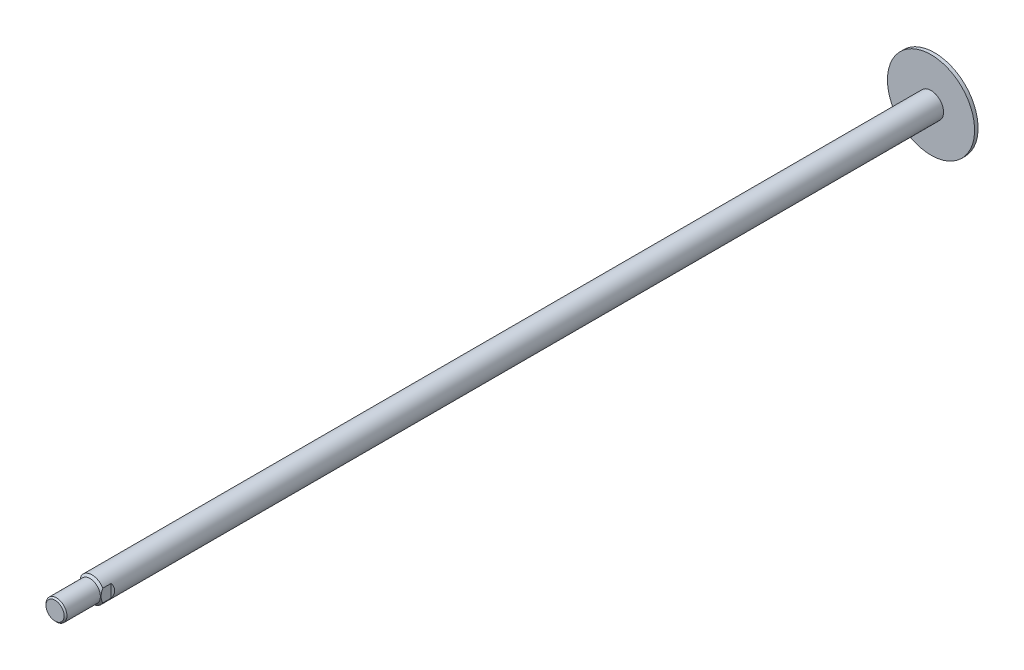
ISO-10303-21;
HEADER;
FILE_DESCRIPTION(('STEP AP214'),'2;1');
FILE_NAME('part.step','',(''),(''),'','','');
FILE_SCHEMA(('AUTOMOTIVE_DESIGN { 1 0 10303 214 1 1 1 1 }'));
ENDSEC;
DATA;
#1=APPLICATION_CONTEXT('core data for automotive mechanical design processes');
#2=APPLICATION_PROTOCOL_DEFINITION('international standard','automotive_design',2000,#1);
#3=PRODUCT_CONTEXT('',#1,'mechanical');
#4=PRODUCT('Part','Part','',(#3));
#5=PRODUCT_RELATED_PRODUCT_CATEGORY('part','',(#4));
#6=PRODUCT_DEFINITION_FORMATION('','',#4);
#7=PRODUCT_DEFINITION_CONTEXT('part definition',#1,'design');
#8=PRODUCT_DEFINITION('design','',#6,#7);
#9=PRODUCT_DEFINITION_SHAPE('','',#8);
#10=(LENGTH_UNIT() NAMED_UNIT(*) SI_UNIT(.MILLI.,.METRE.));
#11=(NAMED_UNIT(*) PLANE_ANGLE_UNIT() SI_UNIT($,.RADIAN.));
#12=(NAMED_UNIT(*) SI_UNIT($,.STERADIAN.) SOLID_ANGLE_UNIT());
#13=UNCERTAINTY_MEASURE_WITH_UNIT(LENGTH_MEASURE(1.E-05),#10,'distance_accuracy_value','');
#14=(GEOMETRIC_REPRESENTATION_CONTEXT(3) GLOBAL_UNCERTAINTY_ASSIGNED_CONTEXT((#13)) GLOBAL_UNIT_ASSIGNED_CONTEXT((#10,
#11,#12)) REPRESENTATION_CONTEXT('',''));
#15=CARTESIAN_POINT('',(0.,0.,0.));
#16=DIRECTION('',(0.,0.,1.));
#17=DIRECTION('',(1.,0.,0.));
#18=AXIS2_PLACEMENT_3D('',#15,#16,#17);
#19=CARTESIAN_POINT('',(0.,0.,1312.41168824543));
#20=DIRECTION('',(0.,0.,-1.));
#21=DIRECTION('',(-1.,0.,0.));
#22=AXIS2_PLACEMENT_3D('',#19,#20,#21);
#23=CYLINDRICAL_SURFACE('',#22,18.);
#24=DIRECTION('',(0.,0.,-1.));
#25=VECTOR('',#24,1.);
#26=CARTESIAN_POINT('',(-15.4999999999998,-9.15150260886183,1312.41168824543));
#27=LINE('',#26,#25);
#28=CARTESIAN_POINT('',(-15.4999999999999,-9.15150260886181,1208.5));
#29=VERTEX_POINT('',#28);
#30=CARTESIAN_POINT('',(-15.4999999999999,-9.15150260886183,1196.5));
#31=VERTEX_POINT('',#30);
#32=EDGE_CURVE('E48',#29,#31,#27,.T.);
#33=ORIENTED_EDGE('',*,*,#32,.T.);
#34=CARTESIAN_POINT('',(0.,0.,1212.));
#35=DIRECTION('',(0.707106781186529,0.,-0.707106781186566));
#36=DIRECTION('',(-0.707106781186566,0.,-0.707106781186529));
#37=AXIS2_PLACEMENT_3D('',#34,#35,#36);
#38=ELLIPSE('',#37,25.4558441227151,18.);
#39=CARTESIAN_POINT('',(-15.4999999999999,9.15150260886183,1196.5));
#40=VERTEX_POINT('',#39);
#41=EDGE_CURVE('E11',#31,#40,#38,.T.);
#42=ORIENTED_EDGE('',*,*,#41,.T.);
#43=DIRECTION('',(0.,0.,-1.));
#44=VECTOR('',#43,1.);
#45=CARTESIAN_POINT('',(-15.4999999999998,9.15150260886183,1312.41168824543));
#46=LINE('',#45,#44);
#47=CARTESIAN_POINT('',(-15.4999999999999,9.15150260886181,1208.5));
#48=VERTEX_POINT('',#47);
#49=EDGE_CURVE('E79',#40,#48,#46,.F.);
#50=ORIENTED_EDGE('',*,*,#49,.T.);
#51=CARTESIAN_POINT('',(0.,0.,1208.5));
#52=DIRECTION('',(0.,0.,-1.));
#53=DIRECTION('',(-1.,0.,0.));
#54=AXIS2_PLACEMENT_3D('',#51,#52,#53);
#55=CIRCLE('',#54,18.);
#56=CARTESIAN_POINT('',(15.5000000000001,9.15150260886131,1208.5));
#57=VERTEX_POINT('',#56);
#58=EDGE_CURVE('E56',#48,#57,#55,.T.);
#59=ORIENTED_EDGE('',*,*,#58,.T.);
#60=DIRECTION('',(0.,0.,-1.));
#61=VECTOR('',#60,1.);
#62=CARTESIAN_POINT('',(15.5000000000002,9.15150260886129,1312.41168824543));
#63=LINE('',#62,#61);
#64=CARTESIAN_POINT('',(15.5000000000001,9.15150260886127,1196.5));
#65=VERTEX_POINT('',#64);
#66=EDGE_CURVE('E94',#57,#65,#63,.T.);
#67=ORIENTED_EDGE('',*,*,#66,.T.);
#68=CARTESIAN_POINT('',(0.,0.,1212.));
#69=DIRECTION('',(-0.707106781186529,0.,-0.707106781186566));
#70=DIRECTION('',(0.707106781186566,0.,-0.707106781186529));
#71=AXIS2_PLACEMENT_3D('',#68,#69,#70);
#72=ELLIPSE('',#71,25.4558441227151,18.);
#73=CARTESIAN_POINT('',(15.5000000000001,-9.15150260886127,1196.5));
#74=VERTEX_POINT('',#73);
#75=EDGE_CURVE('E123',#65,#74,#72,.T.);
#76=ORIENTED_EDGE('',*,*,#75,.T.);
#77=DIRECTION('',(0.,0.,-1.));
#78=VECTOR('',#77,1.);
#79=CARTESIAN_POINT('',(15.5000000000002,-9.15150260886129,1312.41168824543));
#80=LINE('',#79,#78);
#81=CARTESIAN_POINT('',(15.5000000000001,-9.15150260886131,1208.5));
#82=VERTEX_POINT('',#81);
#83=EDGE_CURVE('E89',#74,#82,#80,.F.);
#84=ORIENTED_EDGE('',*,*,#83,.T.);
#85=EDGE_CURVE('E85',#82,#29,#55,.T.);
#86=ORIENTED_EDGE('',*,*,#85,.T.);
#87=EDGE_LOOP('',(#33,#42,#50,#59,#67,#76,#84,#86));
#88=FACE_BOUND('',#87,.T.);
#89=CARTESIAN_POINT('',(0.,0.,5.));
#90=DIRECTION('',(0.,0.,-1.));
#91=DIRECTION('',(-1.,0.,0.));
#92=AXIS2_PLACEMENT_3D('',#89,#90,#91);
#93=CIRCLE('',#92,18.);
#94=CARTESIAN_POINT('',(-18.,0.,5.));
#95=VERTEX_POINT('',#94);
#96=EDGE_CURVE('E110',#95,#95,#93,.T.);
#97=ORIENTED_EDGE('',*,*,#96,.F.);
#98=EDGE_LOOP('',(#97));
#99=FACE_BOUND('',#98,.T.);
#100=ADVANCED_FACE('F34',(#88,#99),#23,.T.);
#101=CARTESIAN_POINT('',(0.,0.,5.));
#102=DIRECTION('',(0.,0.,-1.));
#103=DIRECTION('',(-1.,0.,0.));
#104=AXIS2_PLACEMENT_3D('',#101,#102,#103);
#105=PLANE('',#104);
#106=CARTESIAN_POINT('',(0.,0.,5.));
#107=DIRECTION('',(0.,0.,-1.));
#108=DIRECTION('',(-1.,0.,0.));
#109=AXIS2_PLACEMENT_3D('',#106,#107,#108);
#110=CIRCLE('',#109,62.5);
#111=CARTESIAN_POINT('',(-62.5,0.,5.));
#112=VERTEX_POINT('',#111);
#113=EDGE_CURVE('E107',#112,#112,#110,.T.);
#114=ORIENTED_EDGE('',*,*,#113,.F.);
#115=EDGE_LOOP('',(#114));
#116=FACE_BOUND('',#115,.T.);
#117=ORIENTED_EDGE('',*,*,#96,.T.);
#118=EDGE_LOOP('',(#117));
#119=FACE_BOUND('',#118,.T.);
#120=ADVANCED_FACE('F145',(#116,#119),#105,.F.);
#121=CARTESIAN_POINT('',(0.,0.,5.));
#122=DIRECTION('',(0.,0.,-1.));
#123=DIRECTION('',(-1.,0.,0.));
#124=AXIS2_PLACEMENT_3D('',#121,#122,#123);
#125=CYLINDRICAL_SURFACE('',#124,62.5);
#126=ORIENTED_EDGE('',*,*,#113,.T.);
#127=EDGE_LOOP('',(#126));
#128=FACE_BOUND('',#127,.T.);
#129=CARTESIAN_POINT('',(0.,0.,0.));
#130=DIRECTION('',(0.,0.,-1.));
#131=DIRECTION('',(-1.,0.,0.));
#132=AXIS2_PLACEMENT_3D('',#129,#130,#131);
#133=CIRCLE('',#132,62.5);
#134=CARTESIAN_POINT('',(-62.5,0.,0.));
#135=VERTEX_POINT('',#134);
#136=EDGE_CURVE('E106',#135,#135,#133,.T.);
#137=ORIENTED_EDGE('',*,*,#136,.F.);
#138=EDGE_LOOP('',(#137));
#139=FACE_BOUND('',#138,.T.);
#140=ADVANCED_FACE('F149',(#128,#139),#125,.T.);
#141=CARTESIAN_POINT('',(0.,0.,0.));
#142=DIRECTION('',(0.,0.,1.));
#143=DIRECTION('',(1.,0.,0.));
#144=AXIS2_PLACEMENT_3D('',#141,#142,#143);
#145=PLANE('',#144);
#146=ORIENTED_EDGE('',*,*,#136,.T.);
#147=EDGE_LOOP('',(#146));
#148=FACE_BOUND('',#147,.T.);
#149=ADVANCED_FACE('F155',(#148),#145,.F.);
#150=CARTESIAN_POINT('',(0.,0.,1261.5));
#151=DIRECTION('',(0.,0.,-1.));
#152=DIRECTION('',(-1.,0.,0.));
#153=AXIS2_PLACEMENT_3D('',#150,#151,#152);
#154=CONICAL_SURFACE('',#153,12.9999999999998,0.785398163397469);
#155=CARTESIAN_POINT('',(0.,0.,1259.5));
#156=DIRECTION('',(0.,0.,-1.));
#157=DIRECTION('',(-1.,0.,0.));
#158=AXIS2_PLACEMENT_3D('',#155,#156,#157);
#159=CIRCLE('',#158,14.9999999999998);
#160=CARTESIAN_POINT('',(-14.9999999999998,0.,1259.5));
#161=VERTEX_POINT('',#160);
#162=EDGE_CURVE('E100',#161,#161,#159,.T.);
#163=ORIENTED_EDGE('',*,*,#162,.F.);
#164=EDGE_LOOP('',(#163));
#165=FACE_BOUND('',#164,.T.);
#166=CARTESIAN_POINT('',(0.,0.,1261.5));
#167=DIRECTION('',(0.,0.,-1.));
#168=DIRECTION('',(-1.,0.,0.));
#169=AXIS2_PLACEMENT_3D('',#166,#167,#168);
#170=CIRCLE('',#169,12.9999999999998);
#171=CARTESIAN_POINT('',(-12.9999999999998,0.,1261.5));
#172=VERTEX_POINT('',#171);
#173=EDGE_CURVE('E103',#172,#172,#170,.T.);
#174=ORIENTED_EDGE('',*,*,#173,.T.);
#175=EDGE_LOOP('',(#174));
#176=FACE_BOUND('',#175,.T.);
#177=ADVANCED_FACE('F161',(#165,#176),#154,.T.);
#178=CARTESIAN_POINT('',(0.,0.,0.));
#179=DIRECTION('',(0.,0.,-1.));
#180=DIRECTION('',(-1.,0.,0.));
#181=AXIS2_PLACEMENT_3D('',#178,#179,#180);
#182=CYLINDRICAL_SURFACE('',#181,14.9999999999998);
#183=CARTESIAN_POINT('',(0.,0.,1211.5));
#184=DIRECTION('',(0.,0.,-1.));
#185=DIRECTION('',(-1.,0.,0.));
#186=AXIS2_PLACEMENT_3D('',#183,#184,#185);
#187=CIRCLE('',#186,14.9999999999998);
#188=CARTESIAN_POINT('',(-14.9999999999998,0.,1211.5));
#189=VERTEX_POINT('',#188);
#190=EDGE_CURVE('E97',#189,#189,#187,.T.);
#191=ORIENTED_EDGE('',*,*,#190,.F.);
#192=EDGE_LOOP('',(#191));
#193=FACE_BOUND('',#192,.T.);
#194=ORIENTED_EDGE('',*,*,#162,.T.);
#195=EDGE_LOOP('',(#194));
#196=FACE_BOUND('',#195,.T.);
#197=ADVANCED_FACE('F167',(#193,#196),#182,.T.);
#198=CARTESIAN_POINT('',(0.,0.,1211.5));
#199=DIRECTION('',(0.,0.,-1.));
#200=DIRECTION('',(-1.,0.,0.));
#201=AXIS2_PLACEMENT_3D('',#198,#199,#200);
#202=CONICAL_SURFACE('',#201,14.9999999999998,0.785398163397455);
#203=ORIENTED_EDGE('',*,*,#58,.F.);
#204=CARTESIAN_POINT('',(-15.4999999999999,-29.6331590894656,1193.05789902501));
#205=CARTESIAN_POINT('',(-15.4999999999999,-29.2882625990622,1193.36350954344));
#206=CARTESIAN_POINT('',(-15.4999999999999,-28.9428010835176,1193.66848206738));
#207=CARTESIAN_POINT('',(-15.4999999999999,-28.2506310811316,1194.27701245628));
#208=CARTESIAN_POINT('',(-15.4999999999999,-27.9039225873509,1194.58057031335));
#209=CARTESIAN_POINT('',(-15.4999999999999,-26.8616807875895,1195.48897522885));
#210=CARTESIAN_POINT('',(-15.4999999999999,-26.1641068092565,1196.09148649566));
#211=CARTESIAN_POINT('',(-15.4999999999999,-24.7590802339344,1197.29164529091));
#212=CARTESIAN_POINT('',(-15.4999999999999,-24.0515965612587,1197.88925647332));
#213=CARTESIAN_POINT('',(-15.4999999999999,-22.6285413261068,1199.07472588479));
#214=CARTESIAN_POINT('',(-15.4999999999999,-21.9129701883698,1199.66258462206));
#215=CARTESIAN_POINT('',(-15.4999999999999,-20.809196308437,1200.55348379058));
#216=CARTESIAN_POINT('',(-15.4999999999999,-20.4246008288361,1200.86099547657));
#217=CARTESIAN_POINT('',(-15.4999999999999,-19.6521982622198,1201.47195580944));
#218=CARTESIAN_POINT('',(-15.4999999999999,-19.2643912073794,1201.77540449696));
#219=CARTESIAN_POINT('',(-15.4999999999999,-18.4850794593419,1202.37766585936));
#220=CARTESIAN_POINT('',(-15.4999999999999,-18.0935741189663,1202.67647769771));
#221=CARTESIAN_POINT('',(-15.4999999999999,-17.3064528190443,1203.26864043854));
#222=CARTESIAN_POINT('',(-15.4999999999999,-16.9108368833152,1203.56199137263));
#223=CARTESIAN_POINT('',(-15.4999999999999,-16.115728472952,1204.14171717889));
#224=CARTESIAN_POINT('',(-15.4999999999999,-15.7162453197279,1204.42810481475));
#225=CARTESIAN_POINT('',(-15.4999999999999,-14.9119734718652,1204.99337081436));
#226=CARTESIAN_POINT('',(-15.4999999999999,-14.5071846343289,1205.27224897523));
#227=CARTESIAN_POINT('',(-15.4999999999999,-13.6917121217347,1205.82097617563));
#228=CARTESIAN_POINT('',(-15.4999999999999,-13.2810304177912,1206.09082813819));
#229=CARTESIAN_POINT('',(-15.4999999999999,-12.4528419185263,1206.61981612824));
#230=CARTESIAN_POINT('',(-15.4999999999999,-12.0353357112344,1206.87895307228));
#231=CARTESIAN_POINT('',(-15.4999999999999,-11.3241331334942,1207.3054104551));
#232=CARTESIAN_POINT('',(-15.4999999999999,-11.0324790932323,1207.47613725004));
#233=CARTESIAN_POINT('',(-15.4999999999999,-10.4451804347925,1207.81060435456));
#234=CARTESIAN_POINT('',(-15.4999999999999,-10.1495358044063,1207.97434464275));
#235=CARTESIAN_POINT('',(-15.4999999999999,-9.55384170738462,1208.29388320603));
#236=CARTESIAN_POINT('',(-15.4999999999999,-9.25379074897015,1208.44967870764));
#237=CARTESIAN_POINT('',(-15.4999999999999,-8.64909067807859,1208.75209279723));
#238=CARTESIAN_POINT('',(-15.4999999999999,-8.34444158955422,1208.898711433));
#239=CARTESIAN_POINT('',(-15.4999999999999,-7.73311691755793,1209.18012191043));
#240=CARTESIAN_POINT('',(-15.4999999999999,-7.4264862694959,1209.315010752));
#241=CARTESIAN_POINT('',(-15.4999999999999,-6.80830067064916,1209.57298023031));
#242=CARTESIAN_POINT('',(-15.4999999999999,-6.49674535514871,1209.69605998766));
#243=CARTESIAN_POINT('',(-15.4999999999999,-5.55484283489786,1210.04501278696));
#244=CARTESIAN_POINT('',(-15.4999999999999,-4.91675132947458,1210.25083861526));
#245=CARTESIAN_POINT('',(-15.4999999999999,-3.81891797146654,1210.54239062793));
#246=CARTESIAN_POINT('',(-15.4999999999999,-3.3638028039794,1210.64560844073));
#247=CARTESIAN_POINT('',(-15.4999999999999,-2.44661443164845,1210.814560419));
#248=CARTESIAN_POINT('',(-15.4999999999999,-1.98454248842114,1210.88030129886));
#249=CARTESIAN_POINT('',(-15.4999999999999,-1.0577246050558,1210.97077598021));
#250=CARTESIAN_POINT('',(-15.4999999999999,-0.592990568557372,1210.9956301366));
#251=CARTESIAN_POINT('',(-15.4999999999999,0.336845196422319,1211.00331164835));
#252=CARTESIAN_POINT('',(-15.4999999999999,0.801946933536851,1210.98613798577));
#253=CARTESIAN_POINT('',(-15.4999999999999,1.72588496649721,1210.91096942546));
#254=CARTESIAN_POINT('',(-15.4999999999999,2.18474222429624,1210.85322784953));
#255=CARTESIAN_POINT('',(-15.4999999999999,3.0961049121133,1210.70019290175));
#256=CARTESIAN_POINT('',(-15.4999999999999,3.5486097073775,1210.60489580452));
#257=CARTESIAN_POINT('',(-15.4999999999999,4.45011094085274,1210.37980306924));
#258=CARTESIAN_POINT('',(-15.4999999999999,4.89901500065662,1210.24964181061));
#259=CARTESIAN_POINT('',(-15.4999999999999,5.78712301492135,1209.96021415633));
#260=CARTESIAN_POINT('',(-15.4999999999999,6.2263288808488,1209.80095355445));
#261=CARTESIAN_POINT('',(-15.4999999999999,7.2733251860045,1209.38760412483));
#262=CARTESIAN_POINT('',(-15.4999999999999,7.8763245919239,1209.12142241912));
#263=CARTESIAN_POINT('',(-15.4999999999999,9.06453222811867,1208.55163843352));
#264=CARTESIAN_POINT('',(-15.4999999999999,9.64972914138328,1208.24801294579));
#265=CARTESIAN_POINT('',(-15.4999999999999,10.8064399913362,1207.61097397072));
#266=CARTESIAN_POINT('',(-15.4999999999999,11.3778937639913,1207.27745210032));
#267=CARTESIAN_POINT('',(-15.4999999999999,12.5070366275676,1206.58829308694));
#268=CARTESIAN_POINT('',(-15.4999999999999,13.0647287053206,1206.23266080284));
#269=CARTESIAN_POINT('',(-15.4999999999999,14.1399340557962,1205.52302813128));
#270=CARTESIAN_POINT('',(-15.4999999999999,14.6580287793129,1205.16990421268));
#271=CARTESIAN_POINT('',(-15.4999999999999,15.6855213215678,1204.45117195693));
#272=CARTESIAN_POINT('',(-15.4999999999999,16.1949184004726,1204.0855625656));
#273=CARTESIAN_POINT('',(-15.4999999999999,17.2017062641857,1203.34762353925));
#274=CARTESIAN_POINT('',(-15.4999999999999,17.6991640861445,1202.9753851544));
#275=CARTESIAN_POINT('',(-15.4999999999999,18.4406284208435,1202.41097429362));
#276=CARTESIAN_POINT('',(-15.4999999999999,18.6869660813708,1202.22185212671));
#277=CARTESIAN_POINT('',(-15.4999999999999,19.1781996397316,1201.84175267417));
#278=CARTESIAN_POINT('',(-15.4999999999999,19.4230955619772,1201.65077542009));
#279=CARTESIAN_POINT('',(-15.4999999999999,19.6673304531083,1201.45895594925));
#280=B_SPLINE_CURVE_WITH_KNOTS('',3,(#204,#205,#206,#207,#208,#209,#210,#211,#212,#213,#214,
#215,#216,#217,#218,#219,#220,#221,#222,#223,#224,#225,#226,#227,#228,#229,#230,#231,#232,#233,
#234,#235,#236,#237,#238,#239,#240,#241,#242,#243,#244,#245,#246,#247,#248,#249,#250,#251,#252,
#253,#254,#255,#256,#257,#258,#259,#260,#261,#262,#263,#264,#265,#266,#267,#268,#269,#270,#271,
#272,#273,#274,#275,#276,#277,#278,#279),.UNSPECIFIED.,.F.,.F.,(4,2,2,2,2,2,2,2,2,2,2,2,2,2,2,2,
2,2,2,2,2,2,2,2,2,2,2,2,2,2,2,2,2,2,2,2,2,4),(0.,1.3824463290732,2.76490036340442,
5.53011184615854,8.30836626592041,11.0864754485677,12.5637125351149,14.0409348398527,
15.5184206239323,16.995897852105,18.4704239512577,19.9449898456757,21.4190735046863,
22.893030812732,23.9067980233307,24.920568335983,25.9346901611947,26.948806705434,
27.9535262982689,28.9583206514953,30.9662300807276,32.3649335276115,33.7633863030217,
35.1577151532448,36.5520777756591,37.9378099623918,39.3236796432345,40.7246941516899,
42.1254300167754,44.1010534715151,46.0779076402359,48.0622431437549,50.0461441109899,
51.9268991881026,53.8078134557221,55.6716367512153,56.6033189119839,57.5349852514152),.UNSPECIFIED.);
#281=EDGE_CURVE('E41',#48,#29,#280,.F.);
#282=ORIENTED_EDGE('',*,*,#281,.T.);
#283=ORIENTED_EDGE('',*,*,#85,.F.);
#284=CARTESIAN_POINT('',(15.5000000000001,-29.6331590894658,1193.05789902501));
#285=CARTESIAN_POINT('',(15.5000000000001,-29.2882625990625,1193.36350954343));
#286=CARTESIAN_POINT('',(15.5000000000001,-28.9428010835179,1193.66848206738));
#287=CARTESIAN_POINT('',(15.5000000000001,-28.250631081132,1194.27701245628));
#288=CARTESIAN_POINT('',(15.5000000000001,-27.9039225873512,1194.58057031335));
#289=CARTESIAN_POINT('',(15.5000000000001,-26.8616807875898,1195.48897522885));
#290=CARTESIAN_POINT('',(15.5000000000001,-26.1641068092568,1196.09148649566));
#291=CARTESIAN_POINT('',(15.5000000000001,-24.7590802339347,1197.29164529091));
#292=CARTESIAN_POINT('',(15.5000000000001,-24.051596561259,1197.88925647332));
#293=CARTESIAN_POINT('',(15.5000000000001,-22.6285413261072,1199.07472588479));
#294=CARTESIAN_POINT('',(15.5000000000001,-21.91297018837,1199.66258462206));
#295=CARTESIAN_POINT('',(15.5000000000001,-20.8091963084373,1200.55348379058));
#296=CARTESIAN_POINT('',(15.5000000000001,-20.4246008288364,1200.86099547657));
#297=CARTESIAN_POINT('',(15.5000000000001,-19.65219826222,1201.47195580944));
#298=CARTESIAN_POINT('',(15.5000000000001,-19.2643912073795,1201.77540449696));
#299=CARTESIAN_POINT('',(15.5000000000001,-18.4850794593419,1202.37766585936));
#300=CARTESIAN_POINT('',(15.5000000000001,-18.0935741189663,1202.67647769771));
#301=CARTESIAN_POINT('',(15.5000000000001,-17.3064528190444,1203.26864043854));
#302=CARTESIAN_POINT('',(15.5000000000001,-16.9108368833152,1203.56199137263));
#303=CARTESIAN_POINT('',(15.5000000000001,-16.1157284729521,1204.14171717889));
#304=CARTESIAN_POINT('',(15.5000000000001,-15.716245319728,1204.42810481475));
#305=CARTESIAN_POINT('',(15.5000000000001,-14.9119734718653,1204.99337081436));
#306=CARTESIAN_POINT('',(15.5000000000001,-14.507184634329,1205.27224897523));
#307=CARTESIAN_POINT('',(15.5000000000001,-13.6917121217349,1205.82097617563));
#308=CARTESIAN_POINT('',(15.5000000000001,-13.2810304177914,1206.09082813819));
#309=CARTESIAN_POINT('',(15.5000000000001,-12.4528419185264,1206.61981612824));
#310=CARTESIAN_POINT('',(15.5000000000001,-12.0353357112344,1206.87895307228));
#311=CARTESIAN_POINT('',(15.5000000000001,-11.3241331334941,1207.3054104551));
#312=CARTESIAN_POINT('',(15.5000000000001,-11.0324790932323,1207.47613725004));
#313=CARTESIAN_POINT('',(15.5000000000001,-10.4451804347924,1207.81060435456));
#314=CARTESIAN_POINT('',(15.5000000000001,-10.1495358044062,1207.97434464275));
#315=CARTESIAN_POINT('',(15.5000000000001,-9.55384170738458,1208.29388320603));
#316=CARTESIAN_POINT('',(15.5000000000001,-9.25379074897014,1208.44967870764));
#317=CARTESIAN_POINT('',(15.5000000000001,-8.64909067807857,1208.75209279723));
#318=CARTESIAN_POINT('',(15.5000000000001,-8.34444158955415,1208.898711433));
#319=CARTESIAN_POINT('',(15.5000000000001,-7.73311691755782,1209.18012191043));
#320=CARTESIAN_POINT('',(15.5000000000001,-7.4264862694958,1209.315010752));
#321=CARTESIAN_POINT('',(15.5000000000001,-6.80830067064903,1209.57298023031));
#322=CARTESIAN_POINT('',(15.5000000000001,-6.49674535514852,1209.69605998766));
#323=CARTESIAN_POINT('',(15.5000000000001,-5.55484283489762,1210.04501278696));
#324=CARTESIAN_POINT('',(15.5000000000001,-4.91675132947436,1210.25083861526));
#325=CARTESIAN_POINT('',(15.5000000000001,-3.81891797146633,1210.54239062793));
#326=CARTESIAN_POINT('',(15.5000000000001,-3.36380280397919,1210.64560844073));
#327=CARTESIAN_POINT('',(15.5000000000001,-2.44661443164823,1210.814560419));
#328=CARTESIAN_POINT('',(15.5000000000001,-1.9845424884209,1210.88030129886));
#329=CARTESIAN_POINT('',(15.5000000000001,-1.05772460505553,1210.97077598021));
#330=CARTESIAN_POINT('',(15.5000000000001,-0.592990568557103,1210.9956301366));
#331=CARTESIAN_POINT('',(15.5000000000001,0.336845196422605,1211.00331164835));
#332=CARTESIAN_POINT('',(15.5000000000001,0.801946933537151,1210.98613798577));
#333=CARTESIAN_POINT('',(15.5000000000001,1.72588496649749,1210.91096942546));
#334=CARTESIAN_POINT('',(15.5000000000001,2.1847422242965,1210.85322784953));
#335=CARTESIAN_POINT('',(15.5000000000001,3.09610491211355,1210.70019290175));
#336=CARTESIAN_POINT('',(15.5000000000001,3.54860970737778,1210.60489580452));
#337=CARTESIAN_POINT('',(15.5000000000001,4.45011094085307,1210.37980306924));
#338=CARTESIAN_POINT('',(15.5000000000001,4.89901500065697,1210.24964181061));
#339=CARTESIAN_POINT('',(15.5000000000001,5.78712301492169,1209.96021415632));
#340=CARTESIAN_POINT('',(15.5000000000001,6.22632888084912,1209.80095355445));
#341=CARTESIAN_POINT('',(15.5000000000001,7.27332518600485,1209.38760412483));
#342=CARTESIAN_POINT('',(15.5000000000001,7.87632459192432,1209.12142241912));
#343=CARTESIAN_POINT('',(15.5000000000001,9.06453222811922,1208.55163843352));
#344=CARTESIAN_POINT('',(15.5000000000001,9.64972914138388,1208.24801294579));
#345=CARTESIAN_POINT('',(15.5000000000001,10.8064399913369,1207.61097397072));
#346=CARTESIAN_POINT('',(15.5000000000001,11.3778937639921,1207.27745210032));
#347=CARTESIAN_POINT('',(15.5000000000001,12.5070366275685,1206.58829308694));
#348=CARTESIAN_POINT('',(15.5000000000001,13.0647287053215,1206.23266080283));
#349=CARTESIAN_POINT('',(15.5000000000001,14.1399340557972,1205.52302813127));
#350=CARTESIAN_POINT('',(15.5000000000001,14.6580287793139,1205.16990421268));
#351=CARTESIAN_POINT('',(15.5000000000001,15.6855213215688,1204.45117195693));
#352=CARTESIAN_POINT('',(15.5000000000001,16.1949184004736,1204.0855625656));
#353=CARTESIAN_POINT('',(15.5000000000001,17.2017062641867,1203.34762353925));
#354=CARTESIAN_POINT('',(15.5000000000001,17.6991640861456,1202.9753851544));
#355=CARTESIAN_POINT('',(15.5000000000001,18.4406284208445,1202.41097429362));
#356=CARTESIAN_POINT('',(15.5000000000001,18.6869660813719,1202.22185212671));
#357=CARTESIAN_POINT('',(15.5000000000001,19.1781996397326,1201.84175267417));
#358=CARTESIAN_POINT('',(15.5000000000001,19.4230955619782,1201.65077542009));
#359=CARTESIAN_POINT('',(15.5000000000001,19.6673304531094,1201.45895594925));
#360=B_SPLINE_CURVE_WITH_KNOTS('',3,(#284,#285,#286,#287,#288,#289,#290,#291,#292,#293,#294,
#295,#296,#297,#298,#299,#300,#301,#302,#303,#304,#305,#306,#307,#308,#309,#310,#311,#312,#313,
#314,#315,#316,#317,#318,#319,#320,#321,#322,#323,#324,#325,#326,#327,#328,#329,#330,#331,#332,
#333,#334,#335,#336,#337,#338,#339,#340,#341,#342,#343,#344,#345,#346,#347,#348,#349,#350,#351,
#352,#353,#354,#355,#356,#357,#358,#359),.UNSPECIFIED.,.F.,.F.,(4,2,2,2,2,2,2,2,2,2,2,2,2,2,2,2,
2,2,2,2,2,2,2,2,2,2,2,2,2,2,2,2,2,2,2,2,2,4),(0.,1.38244632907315,2.76490036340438,
5.53011184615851,8.30836626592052,11.0864754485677,12.5637125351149,14.0409348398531,
15.5184206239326,16.9958978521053,18.4704239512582,19.9449898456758,21.4190735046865,
22.8930308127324,23.9067980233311,24.9205683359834,25.934690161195,26.9488067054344,
27.9535262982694,28.9583206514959,30.9662300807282,32.364933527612,33.7633863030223,
35.1577151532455,36.5520777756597,37.9378099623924,39.3236796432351,40.7246941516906,
42.1254300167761,44.1010534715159,46.077907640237,48.0622431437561,50.0461441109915,
51.9268991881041,53.8078134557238,55.6716367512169,56.6033189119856,57.5349852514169),.UNSPECIFIED.);
#361=EDGE_CURVE('E115',#82,#57,#360,.T.);
#362=ORIENTED_EDGE('',*,*,#361,.T.);
#363=EDGE_LOOP('',(#203,#282,#283,#362));
#364=FACE_BOUND('',#363,.T.);
#365=ORIENTED_EDGE('',*,*,#190,.T.);
#366=EDGE_LOOP('',(#365));
#367=FACE_BOUND('',#366,.T.);
#368=ADVANCED_FACE('F124',(#364,#367),#202,.T.);
#369=CARTESIAN_POINT('',(0.,0.,1261.5));
#370=DIRECTION('',(0.,0.,-1.));
#371=DIRECTION('',(-1.,0.,0.));
#372=AXIS2_PLACEMENT_3D('',#369,#370,#371);
#373=PLANE('',#372);
#374=ORIENTED_EDGE('',*,*,#173,.F.);
#375=EDGE_LOOP('',(#374));
#376=FACE_BOUND('',#375,.T.);
#377=ADVANCED_FACE('F137',(#376),#373,.F.);
#378=CARTESIAN_POINT('',(18.,-62.5,1194.));
#379=DIRECTION('',(-0.707106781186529,0.,-0.707106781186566));
#380=DIRECTION('',(-0.707106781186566,0.,0.707106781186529));
#381=AXIS2_PLACEMENT_3D('',#378,#379,#380);
#382=PLANE('',#381);
#383=ORIENTED_EDGE('',*,*,#75,.F.);
#384=DIRECTION('',(0.,1.,0.));
#385=VECTOR('',#384,1.);
#386=CARTESIAN_POINT('',(15.5000000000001,-62.5,1196.5));
#387=LINE('',#386,#385);
#388=EDGE_CURVE('E86',#74,#65,#387,.T.);
#389=ORIENTED_EDGE('',*,*,#388,.F.);
#390=EDGE_LOOP('',(#383,#389));
#391=FACE_BOUND('',#390,.T.);
#392=ADVANCED_FACE('F132',(#391),#382,.F.);
#393=CARTESIAN_POINT('',(15.5000000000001,-62.5,1196.5));
#394=DIRECTION('',(-1.,0.,0.));
#395=DIRECTION('',(0.,0.,1.));
#396=AXIS2_PLACEMENT_3D('',#393,#394,#395);
#397=PLANE('',#396);
#398=ORIENTED_EDGE('',*,*,#361,.F.);
#399=ORIENTED_EDGE('',*,*,#83,.F.);
#400=ORIENTED_EDGE('',*,*,#388,.T.);
#401=ORIENTED_EDGE('',*,*,#66,.F.);
#402=EDGE_LOOP('',(#398,#399,#400,#401));
#403=FACE_BOUND('',#402,.T.);
#404=ADVANCED_FACE('F128',(#403),#397,.F.);
#405=CARTESIAN_POINT('',(-17.9999999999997,-62.5,1194.));
#406=DIRECTION('',(0.707106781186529,0.,-0.707106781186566));
#407=DIRECTION('',(-0.707106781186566,0.,-0.707106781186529));
#408=AXIS2_PLACEMENT_3D('',#405,#406,#407);
#409=PLANE('',#408);
#410=ORIENTED_EDGE('',*,*,#41,.F.);
#411=DIRECTION('',(0.,1.,0.));
#412=VECTOR('',#411,1.);
#413=CARTESIAN_POINT('',(-15.4999999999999,-62.5,1196.5));
#414=LINE('',#413,#412);
#415=EDGE_CURVE('E77',#31,#40,#414,.T.);
#416=ORIENTED_EDGE('',*,*,#415,.T.);
#417=EDGE_LOOP('',(#410,#416));
#418=FACE_BOUND('',#417,.T.);
#419=ADVANCED_FACE('F76',(#418),#409,.F.);
#420=CARTESIAN_POINT('',(-15.4999999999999,-62.5,1196.5));
#421=DIRECTION('',(1.,0.,0.));
#422=DIRECTION('',(0.,0.,-1.));
#423=AXIS2_PLACEMENT_3D('',#420,#421,#422);
#424=PLANE('',#423);
#425=ORIENTED_EDGE('',*,*,#281,.F.);
#426=ORIENTED_EDGE('',*,*,#49,.F.);
#427=ORIENTED_EDGE('',*,*,#415,.F.);
#428=ORIENTED_EDGE('',*,*,#32,.F.);
#429=EDGE_LOOP('',(#425,#426,#427,#428));
#430=FACE_BOUND('',#429,.T.);
#431=ADVANCED_FACE('F78',(#430),#424,.F.);
#432=CLOSED_SHELL('',(#100,#120,#140,#149,#177,#197,#368,#377,#392,#404,#419,#431));
#433=MANIFOLD_SOLID_BREP('B2',#432);
#434=ADVANCED_BREP_SHAPE_REPRESENTATION('',(#18,#433),#14);
#435=SHAPE_DEFINITION_REPRESENTATION(#9,#434);
ENDSEC;
END-ISO-10303-21;
